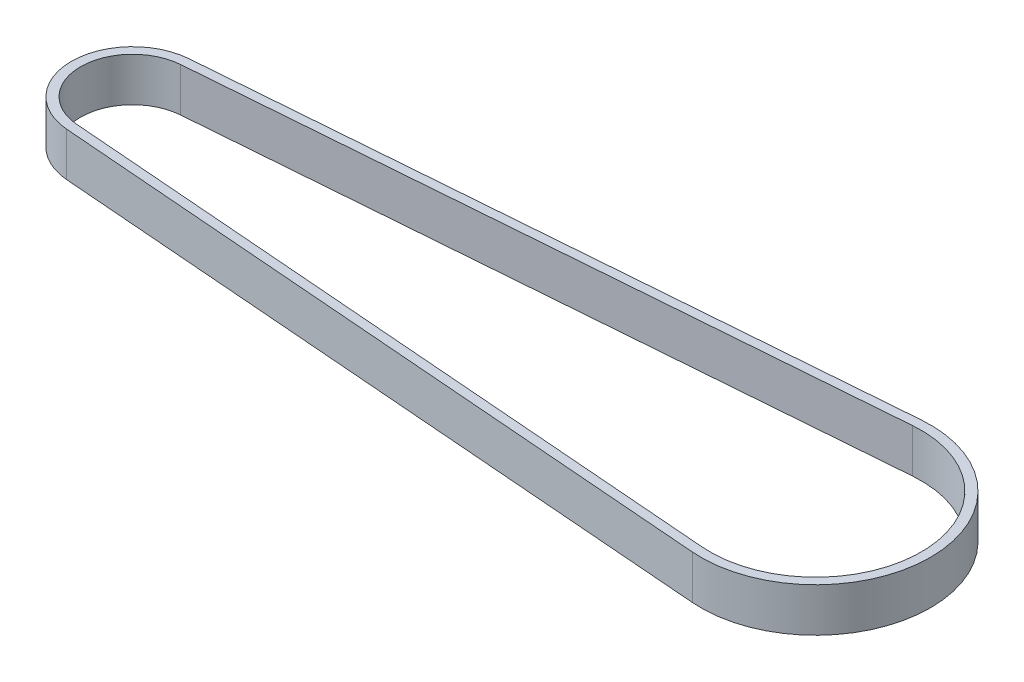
from build123d import *

# Parameters (mm, degrees)
BOSS_EXTRUDE1_DEPTH = 15


with BuildPart() as part:
    # Sketch1 → Boss-Extrude1 (new body)
    with BuildSketch(Plane(origin=(0, 0, 0), x_dir=(1, 0, 0), z_dir=(0, 1, 0))):
        with BuildLine():
            Line((-1.645175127, 20.941275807), (231.139126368, 39.229127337))
            ThreePointArc((231.139126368, 39.229127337), (273.57102, 0), (231.139126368, -39.229127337))
            Line((231.139126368, -39.229127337), (-1.645175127, -20.941275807))
            ThreePointArc((-1.645175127, -20.941275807), (-21.0058, 0), (-1.645175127, 20.941275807))
        make_face()
        with BuildLine():
            Line((-1.396508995, 17.776028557), (231.3877925, 36.063880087))
            ThreePointArc((231.3877925, 36.063880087), (270.39602, 0), (231.3877925, -36.063880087))
            Line((231.3877925, -36.063880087), (-1.396508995, -17.776028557))
            ThreePointArc((-1.396508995, -17.776028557), (-17.8308, 0), (-1.396508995, 17.776028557))
        make_face(mode=Mode.SUBTRACT)
    extrude(amount=BOSS_EXTRUDE1_DEPTH)


solid = part.part
